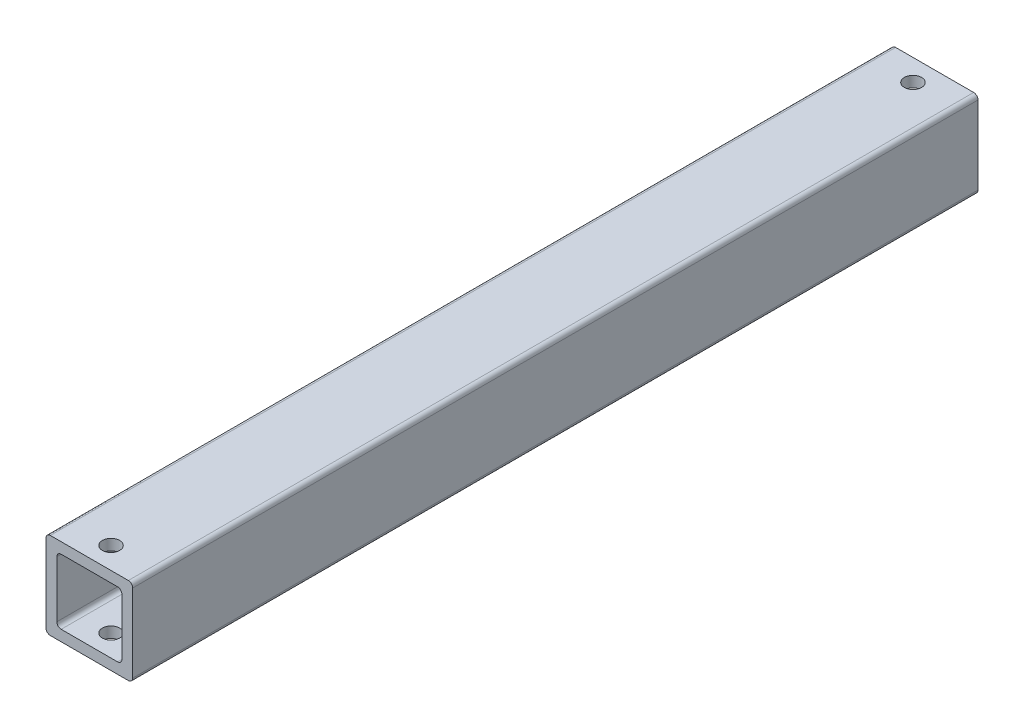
from build123d import *

# Parameters (mm, degrees)
EXTRUDE1_DEPTH     = 685.8
SKETCH2_R          = 5.08
CUT_EXTRUDE1_DEPTH = 689.147832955
SKETCH3_W          = 62.831973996
SKETCH3_H          = 56.22677305
CUT_EXTRUDE2_DEPTH = 457.2
SKETCH4_W          = 91.036406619
SKETCH4_H          = 71.325398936
CUT_EXTRUDE3_DEPTH = 457.2


with BuildPart() as part:
    # Sketch1 → Extrude1 (new, symmetric)
    with BuildSketch(Plane.XY):
        with BuildLine():
            Line((-22.86, -25.4), (22.86, -25.4))
            ThreePointArc((22.86, -25.4), (24.656051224, -24.656051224), (25.4, -22.86))
            Line((25.4, -22.86), (25.4, 22.86))
            ThreePointArc((25.4, 22.86), (24.656051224, 24.656051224), (22.86, 25.4))
            Line((22.86, 25.4), (-22.86, 25.4))
            ThreePointArc((-22.86, 25.4), (-24.656051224, 24.656051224), (-25.4, 22.86))
            Line((-25.4, 22.86), (-25.4, -22.86))
            ThreePointArc((-25.4, -22.86), (-24.656051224, -24.656051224), (-22.86, -25.4))
        make_face()
        with BuildLine():
            Line((-16.51, -19.05), (16.51, -19.05))
            ThreePointArc((16.51, -19.05), (18.306051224, -18.306051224), (19.05, -16.51))
            Line((19.05, -16.51), (19.05, 16.51))
            ThreePointArc((19.05, 16.51), (18.306051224, 18.306051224), (16.51, 19.05))
            Line((16.51, 19.05), (-16.51, 19.05))
            ThreePointArc((-16.51, 19.05), (-18.306051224, 18.306051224), (-19.05, 16.51))
            Line((-19.05, 16.51), (-19.05, -16.51))
            ThreePointArc((-19.05, -16.51), (-18.306051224, -18.306051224), (-16.51, -19.05))
        make_face(mode=Mode.SUBTRACT)
    extrude(amount=EXTRUDE1_DEPTH, both=True)

    # Sketch2 → Cut-Extrude1 (cut, through all)
    with BuildSketch(Plane(origin=(0, 25.4, 0), x_dir=(-1, 0, 0), z_dir=(0, 1, 0))):
        with Locations((0, 234.95)):
            Circle(SKETCH2_R)
        with Locations((0, -234.95)):
            Circle(SKETCH2_R)
        with Locations((0, 508)):
            Circle(SKETCH2_R)
        with Locations((0, -508)):
            Circle(SKETCH2_R)
    extrude(amount=-CUT_EXTRUDE1_DEPTH, mode=Mode.SUBTRACT)

    # Sketch3 → Cut-Extrude2 (cut)
    with BuildSketch(Plane(origin=(0, 0, -247.65), x_dir=(-1, 0, 0), z_dir=(0, 0, -1))):
        with Locations((3.261317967, -0.371542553)):
            Rectangle(SKETCH3_W, SKETCH3_H)
    extrude(amount=CUT_EXTRUDE2_DEPTH, mode=Mode.SUBTRACT)

    # Sketch4 → Cut-Extrude3 (cut)
    with BuildSketch(Plane.XY.offset(247.65)):
        with Locations((13.20840721, -2.336872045)):
            Rectangle(SKETCH4_W, SKETCH4_H)
    extrude(amount=CUT_EXTRUDE3_DEPTH, mode=Mode.SUBTRACT)


solid = part.part
